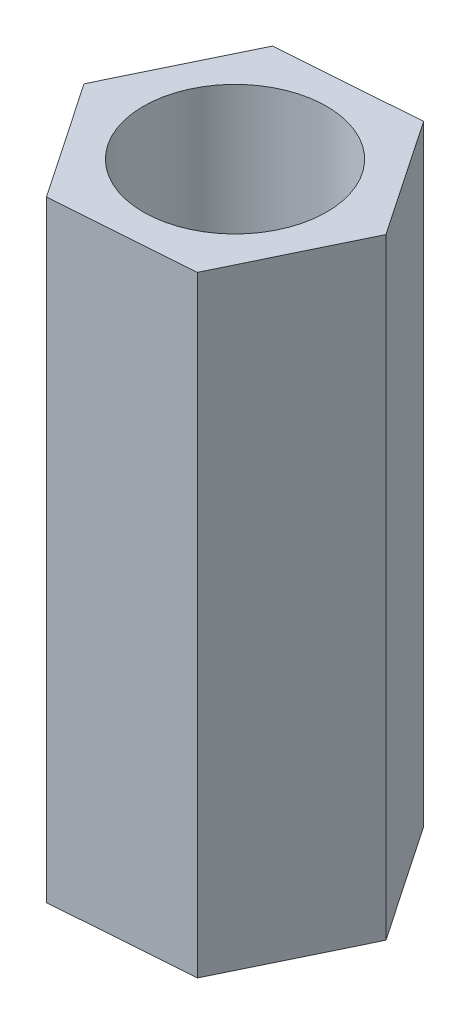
ISO-10303-21;
HEADER;
FILE_DESCRIPTION(('STEP AP214'),'2;1');
FILE_NAME('part.step','',(''),(''),'','','');
FILE_SCHEMA(('AUTOMOTIVE_DESIGN { 1 0 10303 214 1 1 1 1 }'));
ENDSEC;
DATA;
#1=APPLICATION_CONTEXT('core data for automotive mechanical design processes');
#2=APPLICATION_PROTOCOL_DEFINITION('international standard','automotive_design',2000,#1);
#3=PRODUCT_CONTEXT('',#1,'mechanical');
#4=PRODUCT('Part','Part','',(#3));
#5=PRODUCT_RELATED_PRODUCT_CATEGORY('part','',(#4));
#6=PRODUCT_DEFINITION_FORMATION('','',#4);
#7=PRODUCT_DEFINITION_CONTEXT('part definition',#1,'design');
#8=PRODUCT_DEFINITION('design','',#6,#7);
#9=PRODUCT_DEFINITION_SHAPE('','',#8);
#10=(LENGTH_UNIT() NAMED_UNIT(*) SI_UNIT(.MILLI.,.METRE.));
#11=(NAMED_UNIT(*) PLANE_ANGLE_UNIT() SI_UNIT($,.RADIAN.));
#12=(NAMED_UNIT(*) SI_UNIT($,.STERADIAN.) SOLID_ANGLE_UNIT());
#13=UNCERTAINTY_MEASURE_WITH_UNIT(LENGTH_MEASURE(1.E-05),#10,'distance_accuracy_value','');
#14=(GEOMETRIC_REPRESENTATION_CONTEXT(3) GLOBAL_UNCERTAINTY_ASSIGNED_CONTEXT((#13)) GLOBAL_UNIT_ASSIGNED_CONTEXT((#10,
#11,#12)) REPRESENTATION_CONTEXT('',''));
#15=CARTESIAN_POINT('',(0.,0.,0.));
#16=DIRECTION('',(0.,0.,1.));
#17=DIRECTION('',(1.,0.,0.));
#18=AXIS2_PLACEMENT_3D('',#15,#16,#17);
#19=CARTESIAN_POINT('',(0.,10.,0.));
#20=DIRECTION('',(0.,1.,0.));
#21=DIRECTION('',(0.,0.,1.));
#22=AXIS2_PLACEMENT_3D('',#19,#20,#21);
#23=PLANE('',#22);
#24=DIRECTION('',(0.997376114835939,0.,-0.0723939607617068));
#25=VECTOR('',#24,1.);
#26=CARTESIAN_POINT('',(-1.00688281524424,10.,2.07834557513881));
#27=LINE('',#26,#25);
#28=CARTESIAN_POINT('',(-1.00688281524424,10.,2.07834557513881));
#29=VERTEX_POINT('',#28);
#30=CARTESIAN_POINT('',(1.29645865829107,10.,1.91115888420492));
#31=VERTEX_POINT('',#30);
#32=EDGE_CURVE('E129',#29,#31,#27,.T.);
#33=ORIENTED_EDGE('',*,*,#32,.T.);
#34=DIRECTION('',(0.435993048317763,0.,-0.899950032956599));
#35=VECTOR('',#34,1.);
#36=CARTESIAN_POINT('',(1.29645865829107,10.,1.91115888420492));
#37=LINE('',#36,#35);
#38=CARTESIAN_POINT('',(2.30334147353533,10.,-0.167186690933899));
#39=VERTEX_POINT('',#38);
#40=EDGE_CURVE('E87',#31,#39,#37,.T.);
#41=ORIENTED_EDGE('',*,*,#40,.T.);
#42=DIRECTION('',(-0.561383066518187,0.,-0.827556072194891));
#43=VECTOR('',#42,1.);
#44=CARTESIAN_POINT('',(2.30334147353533,10.,-0.167186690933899));
#45=LINE('',#44,#43);
#46=CARTESIAN_POINT('',(1.00688281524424,10.,-2.07834557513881));
#47=VERTEX_POINT('',#46);
#48=EDGE_CURVE('E100',#39,#47,#45,.T.);
#49=ORIENTED_EDGE('',*,*,#48,.T.);
#50=DIRECTION('',(-0.997376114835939,0.,0.0723939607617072));
#51=VECTOR('',#50,1.);
#52=CARTESIAN_POINT('',(1.00688281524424,10.,-2.07834557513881));
#53=LINE('',#52,#51);
#54=CARTESIAN_POINT('',(-1.29645865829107,10.,-1.91115888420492));
#55=VERTEX_POINT('',#54);
#56=EDGE_CURVE('E94',#47,#55,#53,.T.);
#57=ORIENTED_EDGE('',*,*,#56,.T.);
#58=DIRECTION('',(-0.435993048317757,0.,0.899950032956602));
#59=VECTOR('',#58,1.);
#60=CARTESIAN_POINT('',(-1.29645865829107,10.,-1.91115888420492));
#61=LINE('',#60,#59);
#62=CARTESIAN_POINT('',(-2.30334147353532,10.,0.1671866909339));
#63=VERTEX_POINT('',#62);
#64=EDGE_CURVE('E98',#55,#63,#61,.T.);
#65=ORIENTED_EDGE('',*,*,#64,.T.);
#66=DIRECTION('',(0.561383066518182,0.,0.827556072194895));
#67=VECTOR('',#66,1.);
#68=CARTESIAN_POINT('',(-2.30334147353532,10.,0.1671866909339));
#69=LINE('',#68,#67);
#70=EDGE_CURVE('E50',#63,#29,#69,.T.);
#71=ORIENTED_EDGE('',*,*,#70,.T.);
#72=EDGE_LOOP('',(#33,#41,#49,#57,#65,#71));
#73=FACE_BOUND('',#72,.T.);
#74=CARTESIAN_POINT('',(0.,10.,0.));
#75=DIRECTION('',(0.,1.,0.));
#76=DIRECTION('',(0.,0.,1.));
#77=AXIS2_PLACEMENT_3D('',#74,#75,#76);
#78=CIRCLE('',#77,1.5);
#79=CARTESIAN_POINT('',(0.,10.,1.5));
#80=VERTEX_POINT('',#79);
#81=EDGE_CURVE('E122',#80,#80,#78,.T.);
#82=ORIENTED_EDGE('',*,*,#81,.F.);
#83=EDGE_LOOP('',(#82));
#84=FACE_BOUND('',#83,.T.);
#85=ADVANCED_FACE('F33',(#73,#84),#23,.T.);
#86=CARTESIAN_POINT('',(0.,0.,0.));
#87=DIRECTION('',(0.,1.,0.));
#88=DIRECTION('',(0.,0.,1.));
#89=AXIS2_PLACEMENT_3D('',#86,#87,#88);
#90=PLANE('',#89);
#91=DIRECTION('',(0.997376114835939,0.,-0.0723939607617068));
#92=VECTOR('',#91,1.);
#93=CARTESIAN_POINT('',(-1.00688281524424,0.,2.07834557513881));
#94=LINE('',#93,#92);
#95=CARTESIAN_POINT('',(-1.00688281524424,0.,2.07834557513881));
#96=VERTEX_POINT('',#95);
#97=CARTESIAN_POINT('',(1.29645865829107,0.,1.91115888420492));
#98=VERTEX_POINT('',#97);
#99=EDGE_CURVE('E118',#96,#98,#94,.T.);
#100=ORIENTED_EDGE('',*,*,#99,.F.);
#101=DIRECTION('',(0.561383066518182,0.,0.827556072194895));
#102=VECTOR('',#101,1.);
#103=CARTESIAN_POINT('',(-2.30334147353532,0.,0.1671866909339));
#104=LINE('',#103,#102);
#105=CARTESIAN_POINT('',(-2.30334147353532,0.,0.1671866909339));
#106=VERTEX_POINT('',#105);
#107=EDGE_CURVE('E79',#106,#96,#104,.T.);
#108=ORIENTED_EDGE('',*,*,#107,.F.);
#109=DIRECTION('',(-0.435993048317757,0.,0.899950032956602));
#110=VECTOR('',#109,1.);
#111=CARTESIAN_POINT('',(-1.29645865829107,0.,-1.91115888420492));
#112=LINE('',#111,#110);
#113=CARTESIAN_POINT('',(-1.29645865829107,0.,-1.91115888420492));
#114=VERTEX_POINT('',#113);
#115=EDGE_CURVE('E73',#114,#106,#112,.T.);
#116=ORIENTED_EDGE('',*,*,#115,.F.);
#117=DIRECTION('',(-0.997376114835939,0.,0.0723939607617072));
#118=VECTOR('',#117,1.);
#119=CARTESIAN_POINT('',(1.00688281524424,0.,-2.07834557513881));
#120=LINE('',#119,#118);
#121=CARTESIAN_POINT('',(1.00688281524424,0.,-2.07834557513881));
#122=VERTEX_POINT('',#121);
#123=EDGE_CURVE('E108',#122,#114,#120,.T.);
#124=ORIENTED_EDGE('',*,*,#123,.F.);
#125=DIRECTION('',(-0.561383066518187,0.,-0.827556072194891));
#126=VECTOR('',#125,1.);
#127=CARTESIAN_POINT('',(2.30334147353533,0.,-0.167186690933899));
#128=LINE('',#127,#126);
#129=CARTESIAN_POINT('',(2.30334147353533,0.,-0.167186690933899));
#130=VERTEX_POINT('',#129);
#131=EDGE_CURVE('E124',#130,#122,#128,.T.);
#132=ORIENTED_EDGE('',*,*,#131,.F.);
#133=DIRECTION('',(0.435993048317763,0.,-0.899950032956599));
#134=VECTOR('',#133,1.);
#135=CARTESIAN_POINT('',(1.29645865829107,0.,1.91115888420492));
#136=LINE('',#135,#134);
#137=EDGE_CURVE('E121',#98,#130,#136,.T.);
#138=ORIENTED_EDGE('',*,*,#137,.F.);
#139=EDGE_LOOP('',(#100,#108,#116,#124,#132,#138));
#140=FACE_BOUND('',#139,.T.);
#141=CARTESIAN_POINT('',(0.,0.,0.));
#142=DIRECTION('',(0.,1.,0.));
#143=DIRECTION('',(0.,0.,1.));
#144=AXIS2_PLACEMENT_3D('',#141,#142,#143);
#145=CIRCLE('',#144,1.5);
#146=CARTESIAN_POINT('',(0.,0.,1.5));
#147=VERTEX_POINT('',#146);
#148=EDGE_CURVE('E222',#147,#147,#145,.T.);
#149=ORIENTED_EDGE('',*,*,#148,.T.);
#150=EDGE_LOOP('',(#149));
#151=FACE_BOUND('',#150,.T.);
#152=ADVANCED_FACE('F138',(#140,#151),#90,.F.);
#153=CARTESIAN_POINT('',(-1.00688281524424,10.,2.07834557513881));
#154=DIRECTION('',(-0.0723939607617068,0.,-0.997376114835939));
#155=DIRECTION('',(-0.997376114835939,0.,0.0723939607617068));
#156=AXIS2_PLACEMENT_3D('',#153,#154,#155);
#157=PLANE('',#156);
#158=ORIENTED_EDGE('',*,*,#99,.T.);
#159=DIRECTION('',(0.,-1.,0.));
#160=VECTOR('',#159,1.);
#161=CARTESIAN_POINT('',(1.29645865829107,10.,1.91115888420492));
#162=LINE('',#161,#160);
#163=EDGE_CURVE('E11',#31,#98,#162,.T.);
#164=ORIENTED_EDGE('',*,*,#163,.F.);
#165=ORIENTED_EDGE('',*,*,#32,.F.);
#166=DIRECTION('',(0.,-1.,0.));
#167=VECTOR('',#166,1.);
#168=CARTESIAN_POINT('',(-1.00688281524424,10.,2.07834557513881));
#169=LINE('',#168,#167);
#170=EDGE_CURVE('E114',#29,#96,#169,.T.);
#171=ORIENTED_EDGE('',*,*,#170,.T.);
#172=EDGE_LOOP('',(#158,#164,#165,#171));
#173=FACE_BOUND('',#172,.T.);
#174=ADVANCED_FACE('F35',(#173),#157,.F.);
#175=CARTESIAN_POINT('',(1.29645865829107,10.,1.91115888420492));
#176=DIRECTION('',(-0.899950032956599,0.,-0.435993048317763));
#177=DIRECTION('',(-0.435993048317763,0.,0.899950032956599));
#178=AXIS2_PLACEMENT_3D('',#175,#176,#177);
#179=PLANE('',#178);
#180=ORIENTED_EDGE('',*,*,#137,.T.);
#181=DIRECTION('',(0.,-1.,0.));
#182=VECTOR('',#181,1.);
#183=CARTESIAN_POINT('',(2.30334147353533,10.,-0.167186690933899));
#184=LINE('',#183,#182);
#185=EDGE_CURVE('E42',#39,#130,#184,.T.);
#186=ORIENTED_EDGE('',*,*,#185,.F.);
#187=ORIENTED_EDGE('',*,*,#40,.F.);
#188=ORIENTED_EDGE('',*,*,#163,.T.);
#189=EDGE_LOOP('',(#180,#186,#187,#188));
#190=FACE_BOUND('',#189,.T.);
#191=ADVANCED_FACE('F163',(#190),#179,.F.);
#192=CARTESIAN_POINT('',(2.30334147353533,10.,-0.167186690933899));
#193=DIRECTION('',(-0.827556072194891,0.,0.561383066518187));
#194=DIRECTION('',(0.561383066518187,0.,0.827556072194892));
#195=AXIS2_PLACEMENT_3D('',#192,#193,#194);
#196=PLANE('',#195);
#197=ORIENTED_EDGE('',*,*,#131,.T.);
#198=DIRECTION('',(0.,-1.,0.));
#199=VECTOR('',#198,1.);
#200=CARTESIAN_POINT('',(1.00688281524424,10.,-2.07834557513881));
#201=LINE('',#200,#199);
#202=EDGE_CURVE('E109',#47,#122,#201,.T.);
#203=ORIENTED_EDGE('',*,*,#202,.F.);
#204=ORIENTED_EDGE('',*,*,#48,.F.);
#205=ORIENTED_EDGE('',*,*,#185,.T.);
#206=EDGE_LOOP('',(#197,#203,#204,#205));
#207=FACE_BOUND('',#206,.T.);
#208=ADVANCED_FACE('F135',(#207),#196,.F.);
#209=CARTESIAN_POINT('',(1.00688281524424,10.,-2.07834557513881));
#210=DIRECTION('',(0.0723939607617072,0.,0.997376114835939));
#211=DIRECTION('',(0.997376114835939,0.,-0.0723939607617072));
#212=AXIS2_PLACEMENT_3D('',#209,#210,#211);
#213=PLANE('',#212);
#214=ORIENTED_EDGE('',*,*,#123,.T.);
#215=DIRECTION('',(0.,-1.,0.));
#216=VECTOR('',#215,1.);
#217=CARTESIAN_POINT('',(-1.29645865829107,10.,-1.91115888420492));
#218=LINE('',#217,#216);
#219=EDGE_CURVE('E105',#55,#114,#218,.T.);
#220=ORIENTED_EDGE('',*,*,#219,.F.);
#221=ORIENTED_EDGE('',*,*,#56,.F.);
#222=ORIENTED_EDGE('',*,*,#202,.T.);
#223=EDGE_LOOP('',(#214,#220,#221,#222));
#224=FACE_BOUND('',#223,.T.);
#225=ADVANCED_FACE('F106',(#224),#213,.F.);
#226=CARTESIAN_POINT('',(-1.29645865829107,10.,-1.91115888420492));
#227=DIRECTION('',(0.899950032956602,0.,0.435993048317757));
#228=DIRECTION('',(0.435993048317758,0.,-0.899950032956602));
#229=AXIS2_PLACEMENT_3D('',#226,#227,#228);
#230=PLANE('',#229);
#231=ORIENTED_EDGE('',*,*,#115,.T.);
#232=DIRECTION('',(0.,-1.,0.));
#233=VECTOR('',#232,1.);
#234=CARTESIAN_POINT('',(-2.30334147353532,10.,0.1671866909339));
#235=LINE('',#234,#233);
#236=EDGE_CURVE('E110',#63,#106,#235,.T.);
#237=ORIENTED_EDGE('',*,*,#236,.F.);
#238=ORIENTED_EDGE('',*,*,#64,.F.);
#239=ORIENTED_EDGE('',*,*,#219,.T.);
#240=EDGE_LOOP('',(#231,#237,#238,#239));
#241=FACE_BOUND('',#240,.T.);
#242=ADVANCED_FACE('F112',(#241),#230,.F.);
#243=CARTESIAN_POINT('',(-2.30334147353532,10.,0.1671866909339));
#244=DIRECTION('',(0.827556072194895,0.,-0.561383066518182));
#245=DIRECTION('',(-0.561383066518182,0.,-0.827556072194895));
#246=AXIS2_PLACEMENT_3D('',#243,#244,#245);
#247=PLANE('',#246);
#248=ORIENTED_EDGE('',*,*,#107,.T.);
#249=ORIENTED_EDGE('',*,*,#170,.F.);
#250=ORIENTED_EDGE('',*,*,#70,.F.);
#251=ORIENTED_EDGE('',*,*,#236,.T.);
#252=EDGE_LOOP('',(#248,#249,#250,#251));
#253=FACE_BOUND('',#252,.T.);
#254=ADVANCED_FACE('F143',(#253),#247,.F.);
#255=CARTESIAN_POINT('',(0.,10.,0.));
#256=DIRECTION('',(0.,-1.,0.));
#257=DIRECTION('',(0.,0.,-1.));
#258=AXIS2_PLACEMENT_3D('',#255,#256,#257);
#259=CYLINDRICAL_SURFACE('',#258,1.5);
#260=ORIENTED_EDGE('',*,*,#81,.T.);
#261=EDGE_LOOP('',(#260));
#262=FACE_BOUND('',#261,.T.);
#263=ORIENTED_EDGE('',*,*,#148,.F.);
#264=EDGE_LOOP('',(#263));
#265=FACE_BOUND('',#264,.T.);
#266=ADVANCED_FACE('F145',(#262,#265),#259,.F.);
#267=CLOSED_SHELL('',(#85,#152,#174,#191,#208,#225,#242,#254,#266));
#268=MANIFOLD_SOLID_BREP('B2',#267);
#269=ADVANCED_BREP_SHAPE_REPRESENTATION('',(#18,#268),#14);
#270=SHAPE_DEFINITION_REPRESENTATION(#9,#269);
ENDSEC;
END-ISO-10303-21;
